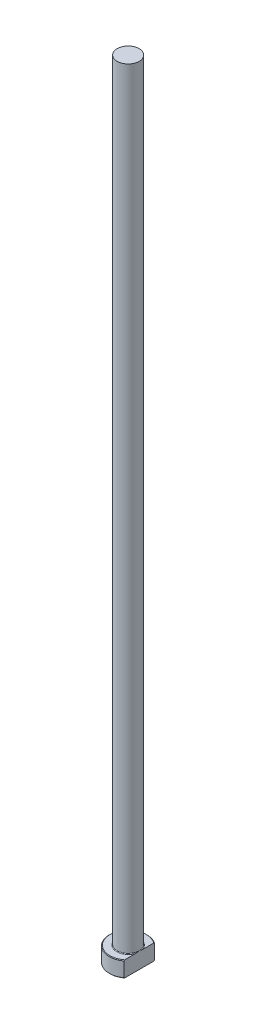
from build123d import *
from build123d.topology import SkipClean

# Parameters (mm, degrees)
CHAMFER1_SIZE = 0.2
FILLET1_R     = 0.2
KEY_DEPTH     = 251.143958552


with BuildPart() as part:
    # Sketch1 → Revolve1 (revolve)
    with BuildSketch(Plane.XY, mode=Mode.PRIVATE) as revolve1_sk:
        Polygon((0, 0), (-6, 0), (-6, 5), (-3.5, 5), (-3.5, 250), (0, 250), align=None)
    revolve(revolve1_sk.sketch.rotate(Axis((0, 259.958771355, 0), (0, -1, 0)), 270), axis=Axis((0, 259.958771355, 0), (0, -1, 0)))

    # Chamfer1
    chamfer1_edges = [part.edges().sort_by_distance(p)[0] for p in [
        (0, 5, -6),
        (0, 0, -6),
    ]]
    chamfer(chamfer1_edges, length=CHAMFER1_SIZE)

    # Fillet1
    fillet1_edges = [part.edges().sort_by_distance(p)[0] for p in [
        (0, 5, -3.5),
    ]]
    fillet(fillet1_edges, radius=FILLET1_R)

    # Sketch2 → KEY (cut, through all)
    with SkipClean():  # the faces are left unmerged after this step: merging them gives an invalid solid
        with BuildSketch(Plane(origin=(0, 0, 0), x_dir=(1, 0, 0), z_dir=(0, 1, 0))):
            with BuildLine():
                Line((3.5, 4.873397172), (3.5, -4.873397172))
                ThreePointArc((3.5, -4.873397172), (6, 0), (3.5, 4.873397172))
            make_face()
        extrude(amount=KEY_DEPTH, mode=Mode.SUBTRACT)


solid = part.part
